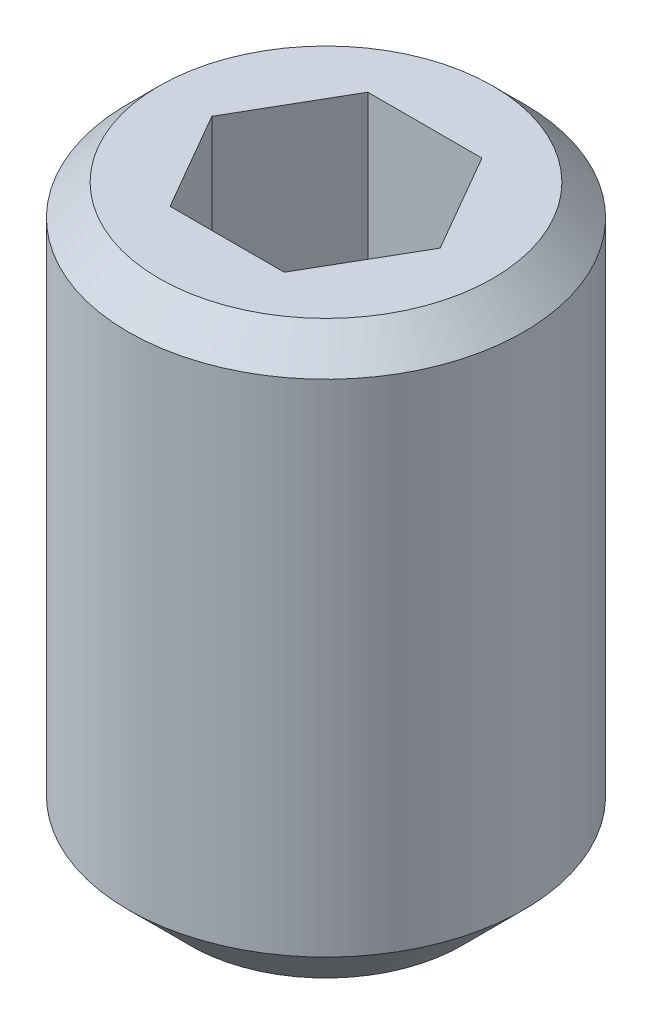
from build123d import *

# Parameters (mm, degrees)
ESQUISSE1_R             = 4
LONGUEUR_FILT_DEPTH     = 12
CHANFREIN1_SIZE         = 0.625
ENL_V_MAT_EXTRU_4_DEPTH = 5
ESQUISSE7_OUTSIDE_W     = 41.832
ESQUISSE7_OUTSIDE_H     = 41.832
ESQUISSE7_OUTSIDE_R     = 2.75
ENL_V_MAT_EXTRU_6_DEPTH = 14.266499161
ENL_V_MAT_EXTRU_6_DRAFT = -45


with BuildPart() as part:
    # Esquisse1 → Longueur filt (new body)
    with BuildSketch(Plane(origin=(0, 0, 0), x_dir=(1, 0, 0), z_dir=(0, 1, 0))):
        with Locations(Location((0, 0, 0), (0, 0, 270))):
            Circle(ESQUISSE1_R)
    extrude(amount=LONGUEUR_FILT_DEPTH)

    # Chanfrein1
    chanfrein1_edges = [part.edges().sort_by_distance(p)[0] for p in [
        (0, 12, -4),
    ]]
    chamfer(chanfrein1_edges, length=CHANFREIN1_SIZE)

    # Esquisse6 → Enl_v. mat.-Extru.4 (cut)
    with BuildSketch(Plane(origin=(0, 12, 0), x_dir=(-1, 0, 0), z_dir=(0, -1, 0))):
        Polygon((2.309401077, 0), (1.154700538, 2), (-1.154700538, 2), (-2.309401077, 0), (-1.154700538, -2), (1.154700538, -2), align=None)
    extrude(amount=ENL_V_MAT_EXTRU_4_DEPTH, mode=Mode.SUBTRACT)


with BuildPart() as enl_v_mat_extru_6_tool:
    # Esquisse7 outside → Enl_v. mat.-Extru.6 (with draft: the straight prism first)
    with BuildSketch(Plane.XZ):
        Rectangle(ESQUISSE7_OUTSIDE_W, ESQUISSE7_OUTSIDE_H)
        Circle(ESQUISSE7_OUTSIDE_R, mode=Mode.SUBTRACT)
    extrude(amount=-ENL_V_MAT_EXTRU_6_DEPTH)
    # Enl_v. mat.-Extru.6: the draft: its side faces are tilted about the plane it starts from
    enl_v_mat_extru_6_sides = [enl_v_mat_extru_6_tool.faces().sort_by_distance(p)[0] for p in [
        (0, 7.133249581, -20.916),
        (20.916, 7.133249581, 0),
        (0, 7.133249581, 20.916),
        (-20.916, 7.133249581, 0),
        (-2.75, 7.133249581, 0),
    ]]
    draft(enl_v_mat_extru_6_sides, Plane.XZ, ENL_V_MAT_EXTRU_6_DRAFT)


with BuildPart() as part_1:
    add(part.part)

    # Enl_v. mat.-Extru.6: cut by enl_v_mat_extru_6_tool
    add(enl_v_mat_extru_6_tool.part, mode=Mode.SUBTRACT)


solid = part_1.part
